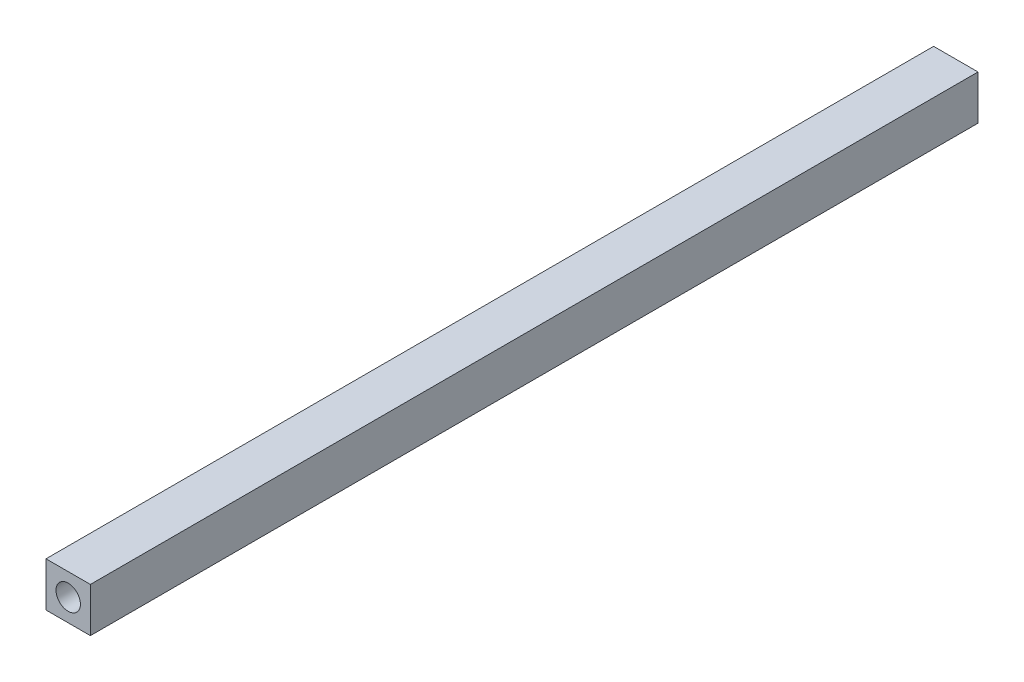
ISO-10303-21;
HEADER;
FILE_DESCRIPTION(('STEP AP214'),'2;1');
FILE_NAME('part.step','',(''),(''),'','','');
FILE_SCHEMA(('AUTOMOTIVE_DESIGN { 1 0 10303 214 1 1 1 1 }'));
ENDSEC;
DATA;
#1=APPLICATION_CONTEXT('core data for automotive mechanical design processes');
#2=APPLICATION_PROTOCOL_DEFINITION('international standard','automotive_design',2000,#1);
#3=PRODUCT_CONTEXT('',#1,'mechanical');
#4=PRODUCT('Part','Part','',(#3));
#5=PRODUCT_RELATED_PRODUCT_CATEGORY('part','',(#4));
#6=PRODUCT_DEFINITION_FORMATION('','',#4);
#7=PRODUCT_DEFINITION_CONTEXT('part definition',#1,'design');
#8=PRODUCT_DEFINITION('design','',#6,#7);
#9=PRODUCT_DEFINITION_SHAPE('','',#8);
#10=(LENGTH_UNIT() NAMED_UNIT(*) SI_UNIT(.MILLI.,.METRE.));
#11=(NAMED_UNIT(*) PLANE_ANGLE_UNIT() SI_UNIT($,.RADIAN.));
#12=(NAMED_UNIT(*) SI_UNIT($,.STERADIAN.) SOLID_ANGLE_UNIT());
#13=UNCERTAINTY_MEASURE_WITH_UNIT(LENGTH_MEASURE(1.E-05),#10,'distance_accuracy_value','');
#14=(GEOMETRIC_REPRESENTATION_CONTEXT(3) GLOBAL_UNCERTAINTY_ASSIGNED_CONTEXT((#13)) GLOBAL_UNIT_ASSIGNED_CONTEXT((#10,
#11,#12)) REPRESENTATION_CONTEXT('',''));
#15=CARTESIAN_POINT('',(0.,0.,0.));
#16=DIRECTION('',(0.,0.,1.));
#17=DIRECTION('',(1.,0.,0.));
#18=AXIS2_PLACEMENT_3D('',#15,#16,#17);
#19=CARTESIAN_POINT('',(0.,0.,-120.));
#20=DIRECTION('',(-1.,0.,0.));
#21=DIRECTION('',(0.,0.,1.));
#22=AXIS2_PLACEMENT_3D('',#19,#20,#21);
#23=PLANE('',#22);
#24=DIRECTION('',(0.,-1.,0.));
#25=VECTOR('',#24,1.);
#26=CARTESIAN_POINT('',(0.,0.,0.));
#27=LINE('',#26,#25);
#28=CARTESIAN_POINT('',(0.,6.,0.));
#29=VERTEX_POINT('',#28);
#30=CARTESIAN_POINT('',(0.,0.,0.));
#31=VERTEX_POINT('',#30);
#32=EDGE_CURVE('E107',#29,#31,#27,.T.);
#33=ORIENTED_EDGE('',*,*,#32,.F.);
#34=DIRECTION('',(0.,0.,1.));
#35=VECTOR('',#34,1.);
#36=CARTESIAN_POINT('',(0.,6.,-120.));
#37=LINE('',#36,#35);
#38=CARTESIAN_POINT('',(0.,6.,-120.));
#39=VERTEX_POINT('',#38);
#40=EDGE_CURVE('E11',#39,#29,#37,.T.);
#41=ORIENTED_EDGE('',*,*,#40,.F.);
#42=DIRECTION('',(0.,-1.,0.));
#43=VECTOR('',#42,1.);
#44=CARTESIAN_POINT('',(0.,0.,-120.));
#45=LINE('',#44,#43);
#46=CARTESIAN_POINT('',(0.,0.,-120.));
#47=VERTEX_POINT('',#46);
#48=EDGE_CURVE('E108',#39,#47,#45,.T.);
#49=ORIENTED_EDGE('',*,*,#48,.T.);
#50=DIRECTION('',(0.,0.,1.));
#51=VECTOR('',#50,1.);
#52=CARTESIAN_POINT('',(0.,0.,-120.));
#53=LINE('',#52,#51);
#54=EDGE_CURVE('E37',#47,#31,#53,.T.);
#55=ORIENTED_EDGE('',*,*,#54,.T.);
#56=EDGE_LOOP('',(#33,#41,#49,#55));
#57=FACE_BOUND('',#56,.T.);
#58=ADVANCED_FACE('F34',(#57),#23,.T.);
#59=CARTESIAN_POINT('',(0.,6.,-120.));
#60=DIRECTION('',(0.,1.,0.));
#61=DIRECTION('',(0.,0.,1.));
#62=AXIS2_PLACEMENT_3D('',#59,#60,#61);
#63=PLANE('',#62);
#64=DIRECTION('',(-1.,0.,0.));
#65=VECTOR('',#64,1.);
#66=CARTESIAN_POINT('',(0.,6.,0.));
#67=LINE('',#66,#65);
#68=CARTESIAN_POINT('',(6.,6.,0.));
#69=VERTEX_POINT('',#68);
#70=EDGE_CURVE('E111',#69,#29,#67,.T.);
#71=ORIENTED_EDGE('',*,*,#70,.F.);
#72=DIRECTION('',(0.,0.,1.));
#73=VECTOR('',#72,1.);
#74=CARTESIAN_POINT('',(6.,6.,-120.));
#75=LINE('',#74,#73);
#76=CARTESIAN_POINT('',(6.,6.,-120.));
#77=VERTEX_POINT('',#76);
#78=EDGE_CURVE('E43',#77,#69,#75,.T.);
#79=ORIENTED_EDGE('',*,*,#78,.F.);
#80=DIRECTION('',(-1.,0.,0.));
#81=VECTOR('',#80,1.);
#82=CARTESIAN_POINT('',(0.,6.,-120.));
#83=LINE('',#82,#81);
#84=EDGE_CURVE('E115',#77,#39,#83,.T.);
#85=ORIENTED_EDGE('',*,*,#84,.T.);
#86=ORIENTED_EDGE('',*,*,#40,.T.);
#87=EDGE_LOOP('',(#71,#79,#85,#86));
#88=FACE_BOUND('',#87,.T.);
#89=ADVANCED_FACE('F130',(#88),#63,.T.);
#90=CARTESIAN_POINT('',(6.,0.,-120.));
#91=DIRECTION('',(1.,0.,0.));
#92=DIRECTION('',(0.,0.,-1.));
#93=AXIS2_PLACEMENT_3D('',#90,#91,#92);
#94=PLANE('',#93);
#95=DIRECTION('',(0.,1.,0.));
#96=VECTOR('',#95,1.);
#97=CARTESIAN_POINT('',(6.,0.,0.));
#98=LINE('',#97,#96);
#99=CARTESIAN_POINT('',(6.,0.,0.));
#100=VERTEX_POINT('',#99);
#101=EDGE_CURVE('E122',#100,#69,#98,.T.);
#102=ORIENTED_EDGE('',*,*,#101,.F.);
#103=DIRECTION('',(0.,0.,1.));
#104=VECTOR('',#103,1.);
#105=CARTESIAN_POINT('',(6.,0.,-120.));
#106=LINE('',#105,#104);
#107=CARTESIAN_POINT('',(6.,0.,-120.));
#108=VERTEX_POINT('',#107);
#109=EDGE_CURVE('E126',#108,#100,#106,.T.);
#110=ORIENTED_EDGE('',*,*,#109,.F.);
#111=DIRECTION('',(0.,1.,0.));
#112=VECTOR('',#111,1.);
#113=CARTESIAN_POINT('',(6.,0.,-120.));
#114=LINE('',#113,#112);
#115=EDGE_CURVE('E113',#108,#77,#114,.T.);
#116=ORIENTED_EDGE('',*,*,#115,.T.);
#117=ORIENTED_EDGE('',*,*,#78,.T.);
#118=EDGE_LOOP('',(#102,#110,#116,#117));
#119=FACE_BOUND('',#118,.T.);
#120=ADVANCED_FACE('F133',(#119),#94,.T.);
#121=CARTESIAN_POINT('',(0.,0.,-120.));
#122=DIRECTION('',(0.,-1.,0.));
#123=DIRECTION('',(0.,0.,-1.));
#124=AXIS2_PLACEMENT_3D('',#121,#122,#123);
#125=PLANE('',#124);
#126=DIRECTION('',(1.,0.,0.));
#127=VECTOR('',#126,1.);
#128=CARTESIAN_POINT('',(0.,0.,0.));
#129=LINE('',#128,#127);
#130=EDGE_CURVE('E119',#31,#100,#129,.T.);
#131=ORIENTED_EDGE('',*,*,#130,.F.);
#132=ORIENTED_EDGE('',*,*,#54,.F.);
#133=DIRECTION('',(1.,0.,0.));
#134=VECTOR('',#133,1.);
#135=CARTESIAN_POINT('',(0.,0.,-120.));
#136=LINE('',#135,#134);
#137=EDGE_CURVE('E110',#47,#108,#136,.T.);
#138=ORIENTED_EDGE('',*,*,#137,.T.);
#139=ORIENTED_EDGE('',*,*,#109,.T.);
#140=EDGE_LOOP('',(#131,#132,#138,#139));
#141=FACE_BOUND('',#140,.T.);
#142=ADVANCED_FACE('F127',(#141),#125,.T.);
#143=CARTESIAN_POINT('',(0.,0.,-120.));
#144=DIRECTION('',(0.,0.,-1.));
#145=DIRECTION('',(-1.,0.,0.));
#146=AXIS2_PLACEMENT_3D('',#143,#144,#145);
#147=PLANE('',#146);
#148=CARTESIAN_POINT('',(2.99573664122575,3.,-120.));
#149=DIRECTION('',(0.,0.,-1.));
#150=DIRECTION('',(-1.,0.,0.));
#151=AXIS2_PLACEMENT_3D('',#148,#149,#150);
#152=CIRCLE('',#151,1.64999999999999);
#153=CARTESIAN_POINT('',(1.34573664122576,3.,-120.));
#154=VERTEX_POINT('',#153);
#155=EDGE_CURVE('E97',#154,#154,#152,.T.);
#156=ORIENTED_EDGE('',*,*,#155,.F.);
#157=EDGE_LOOP('',(#156));
#158=FACE_BOUND('',#157,.T.);
#159=ORIENTED_EDGE('',*,*,#48,.F.);
#160=ORIENTED_EDGE('',*,*,#84,.F.);
#161=ORIENTED_EDGE('',*,*,#115,.F.);
#162=ORIENTED_EDGE('',*,*,#137,.F.);
#163=EDGE_LOOP('',(#159,#160,#161,#162));
#164=FACE_BOUND('',#163,.T.);
#165=ADVANCED_FACE('F135',(#158,#164),#147,.T.);
#166=CARTESIAN_POINT('',(0.,0.,0.));
#167=DIRECTION('',(0.,0.,-1.));
#168=DIRECTION('',(-1.,0.,0.));
#169=AXIS2_PLACEMENT_3D('',#166,#167,#168);
#170=PLANE('',#169);
#171=CARTESIAN_POINT('',(3.,3.,0.));
#172=DIRECTION('',(0.,0.,1.));
#173=DIRECTION('',(1.,0.,0.));
#174=AXIS2_PLACEMENT_3D('',#171,#172,#173);
#175=CIRCLE('',#174,1.64999999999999);
#176=CARTESIAN_POINT('',(4.64999999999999,3.,0.));
#177=VERTEX_POINT('',#176);
#178=EDGE_CURVE('E96',#177,#177,#175,.T.);
#179=ORIENTED_EDGE('',*,*,#178,.F.);
#180=EDGE_LOOP('',(#179));
#181=FACE_BOUND('',#180,.T.);
#182=ORIENTED_EDGE('',*,*,#32,.T.);
#183=ORIENTED_EDGE('',*,*,#130,.T.);
#184=ORIENTED_EDGE('',*,*,#101,.T.);
#185=ORIENTED_EDGE('',*,*,#70,.T.);
#186=EDGE_LOOP('',(#182,#183,#184,#185));
#187=FACE_BOUND('',#186,.T.);
#188=ADVANCED_FACE('F129',(#181,#187),#170,.F.);
#189=CARTESIAN_POINT('',(3.,3.,-11.5));
#190=DIRECTION('',(0.,0.,1.));
#191=DIRECTION('',(1.,0.,0.));
#192=AXIS2_PLACEMENT_3D('',#189,#190,#191);
#193=CONICAL_SURFACE('',#192,1.64999999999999,1.02974425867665);
#194=CARTESIAN_POINT('',(3.,3.,-12.4914200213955));
#195=VERTEX_POINT('',#194);
#196=VERTEX_LOOP('',#195);
#197=FACE_BOUND('',#196,.T.);
#198=CARTESIAN_POINT('',(3.,3.,-11.5));
#199=DIRECTION('',(0.,0.,1.));
#200=DIRECTION('',(1.,0.,0.));
#201=AXIS2_PLACEMENT_3D('',#198,#199,#200);
#202=CIRCLE('',#201,1.64999999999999);
#203=CARTESIAN_POINT('',(4.64999999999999,3.,-11.5));
#204=VERTEX_POINT('',#203);
#205=EDGE_CURVE('E100',#204,#204,#202,.T.);
#206=ORIENTED_EDGE('',*,*,#205,.T.);
#207=EDGE_LOOP('',(#206));
#208=FACE_BOUND('',#207,.T.);
#209=ADVANCED_FACE('F143',(#197,#208),#193,.F.);
#210=CARTESIAN_POINT('',(3.,3.,0.));
#211=DIRECTION('',(0.,0.,1.));
#212=DIRECTION('',(1.,0.,0.));
#213=AXIS2_PLACEMENT_3D('',#210,#211,#212);
#214=CYLINDRICAL_SURFACE('',#213,1.64999999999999);
#215=ORIENTED_EDGE('',*,*,#205,.F.);
#216=EDGE_LOOP('',(#215));
#217=FACE_BOUND('',#216,.T.);
#218=ORIENTED_EDGE('',*,*,#178,.T.);
#219=EDGE_LOOP('',(#218));
#220=FACE_BOUND('',#219,.T.);
#221=ADVANCED_FACE('F90',(#217,#220),#214,.F.);
#222=CARTESIAN_POINT('',(2.99573664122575,3.,-108.5));
#223=DIRECTION('',(0.,0.,-1.));
#224=DIRECTION('',(-1.,0.,0.));
#225=AXIS2_PLACEMENT_3D('',#222,#223,#224);
#226=CONICAL_SURFACE('',#225,1.64999999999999,1.02974425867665);
#227=CARTESIAN_POINT('',(2.99573664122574,3.,-107.508579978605));
#228=VERTEX_POINT('',#227);
#229=VERTEX_LOOP('',#228);
#230=FACE_BOUND('',#229,.T.);
#231=CARTESIAN_POINT('',(2.99573664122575,3.,-108.5));
#232=DIRECTION('',(0.,0.,-1.));
#233=DIRECTION('',(-1.,0.,0.));
#234=AXIS2_PLACEMENT_3D('',#231,#232,#233);
#235=CIRCLE('',#234,1.64999999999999);
#236=CARTESIAN_POINT('',(1.34573664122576,3.,-108.5));
#237=VERTEX_POINT('',#236);
#238=EDGE_CURVE('E94',#237,#237,#235,.T.);
#239=ORIENTED_EDGE('',*,*,#238,.T.);
#240=EDGE_LOOP('',(#239));
#241=FACE_BOUND('',#240,.T.);
#242=ADVANCED_FACE('F86',(#230,#241),#226,.F.);
#243=CARTESIAN_POINT('',(2.99573664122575,3.,-120.));
#244=DIRECTION('',(0.,0.,-1.));
#245=DIRECTION('',(-1.,0.,0.));
#246=AXIS2_PLACEMENT_3D('',#243,#244,#245);
#247=CYLINDRICAL_SURFACE('',#246,1.64999999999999);
#248=ORIENTED_EDGE('',*,*,#238,.F.);
#249=EDGE_LOOP('',(#248));
#250=FACE_BOUND('',#249,.T.);
#251=ORIENTED_EDGE('',*,*,#155,.T.);
#252=EDGE_LOOP('',(#251));
#253=FACE_BOUND('',#252,.T.);
#254=ADVANCED_FACE('F89',(#250,#253),#247,.F.);
#255=CLOSED_SHELL('',(#58,#89,#120,#142,#165,#188,#209,#221,#242,#254));
#256=MANIFOLD_SOLID_BREP('B2',#255);
#257=ADVANCED_BREP_SHAPE_REPRESENTATION('',(#18,#256),#14);
#258=SHAPE_DEFINITION_REPRESENTATION(#9,#257);
ENDSEC;
END-ISO-10303-21;
